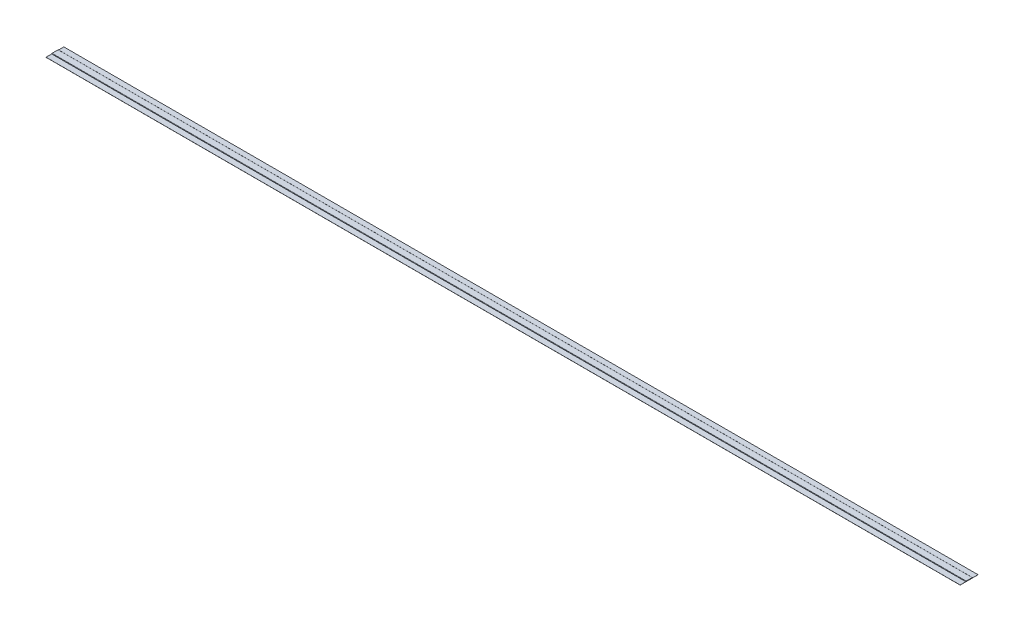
ISO-10303-21;
HEADER;
FILE_DESCRIPTION(('STEP AP214'),'2;1');
FILE_NAME('part.step','',(''),(''),'','','');
FILE_SCHEMA(('AUTOMOTIVE_DESIGN { 1 0 10303 214 1 1 1 1 }'));
ENDSEC;
DATA;
#1=APPLICATION_CONTEXT('core data for automotive mechanical design processes');
#2=APPLICATION_PROTOCOL_DEFINITION('international standard','automotive_design',2000,#1);
#3=PRODUCT_CONTEXT('',#1,'mechanical');
#4=PRODUCT('Part','Part','',(#3));
#5=PRODUCT_RELATED_PRODUCT_CATEGORY('part','',(#4));
#6=PRODUCT_DEFINITION_FORMATION('','',#4);
#7=PRODUCT_DEFINITION_CONTEXT('part definition',#1,'design');
#8=PRODUCT_DEFINITION('design','',#6,#7);
#9=PRODUCT_DEFINITION_SHAPE('','',#8);
#10=(LENGTH_UNIT() NAMED_UNIT(*) SI_UNIT(.MILLI.,.METRE.));
#11=(NAMED_UNIT(*) PLANE_ANGLE_UNIT() SI_UNIT($,.RADIAN.));
#12=(NAMED_UNIT(*) SI_UNIT($,.STERADIAN.) SOLID_ANGLE_UNIT());
#13=UNCERTAINTY_MEASURE_WITH_UNIT(LENGTH_MEASURE(1.E-05),#10,'distance_accuracy_value','');
#14=(GEOMETRIC_REPRESENTATION_CONTEXT(3) GLOBAL_UNCERTAINTY_ASSIGNED_CONTEXT((#13)) GLOBAL_UNIT_ASSIGNED_CONTEXT((#10,
#11,#12)) REPRESENTATION_CONTEXT('',''));
#15=CARTESIAN_POINT('',(0.,0.,0.));
#16=DIRECTION('',(0.,0.,1.));
#17=DIRECTION('',(1.,0.,0.));
#18=AXIS2_PLACEMENT_3D('',#15,#16,#17);
#19=CARTESIAN_POINT('',(-609.6,0.254,23.8125));
#20=DIRECTION('',(0.,1.,0.));
#21=DIRECTION('',(0.,0.,1.));
#22=AXIS2_PLACEMENT_3D('',#19,#20,#21);
#23=PLANE('',#22);
#24=DIRECTION('',(0.,0.,1.));
#25=VECTOR('',#24,1.);
#26=CARTESIAN_POINT('',(-609.6,0.254,-23.8125));
#27=LINE('',#26,#25);
#28=CARTESIAN_POINT('',(-609.6,0.254,-23.8125));
#29=VERTEX_POINT('',#28);
#30=CARTESIAN_POINT('',(-609.6,0.254,-9.396000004));
#31=VERTEX_POINT('',#30);
#32=EDGE_CURVE('E146',#29,#31,#27,.T.);
#33=ORIENTED_EDGE('',*,*,#32,.T.);
#34=DIRECTION('',(1.,0.,0.));
#35=VECTOR('',#34,1.);
#36=CARTESIAN_POINT('',(-627.660600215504,0.254,-9.396000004));
#37=LINE('',#36,#35);
#38=CARTESIAN_POINT('',(1828.8,0.254,-9.396000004));
#39=VERTEX_POINT('',#38);
#40=EDGE_CURVE('E118',#31,#39,#37,.T.);
#41=ORIENTED_EDGE('',*,*,#40,.T.);
#42=DIRECTION('',(0.,0.,-1.));
#43=VECTOR('',#42,1.);
#44=CARTESIAN_POINT('',(1828.8,0.254,-23.8125));
#45=LINE('',#44,#43);
#46=CARTESIAN_POINT('',(1828.8,0.254,-23.8125));
#47=VERTEX_POINT('',#46);
#48=EDGE_CURVE('E132',#39,#47,#45,.T.);
#49=ORIENTED_EDGE('',*,*,#48,.T.);
#50=DIRECTION('',(-1.,0.,0.));
#51=VECTOR('',#50,1.);
#52=CARTESIAN_POINT('',(-609.6,0.254,-23.8125));
#53=LINE('',#52,#51);
#54=EDGE_CURVE('E59',#47,#29,#53,.T.);
#55=ORIENTED_EDGE('',*,*,#54,.T.);
#56=EDGE_LOOP('',(#33,#41,#49,#55));
#57=FACE_BOUND('',#56,.T.);
#58=ADVANCED_FACE('F35',(#57),#23,.T.);
#59=CARTESIAN_POINT('',(-609.6,0.254,-23.8125));
#60=DIRECTION('',(1.,0.,0.));
#61=DIRECTION('',(0.,0.,-1.));
#62=AXIS2_PLACEMENT_3D('',#59,#60,#61);
#63=PLANE('',#62);
#64=DIRECTION('',(0.,0.,1.));
#65=VECTOR('',#64,1.);
#66=CARTESIAN_POINT('',(-609.6,0.,-23.8125));
#67=LINE('',#66,#65);
#68=CARTESIAN_POINT('',(-609.6,0.,-23.8125));
#69=VERTEX_POINT('',#68);
#70=CARTESIAN_POINT('',(-609.6,0.,23.8125));
#71=VERTEX_POINT('',#70);
#72=EDGE_CURVE('E145',#69,#71,#67,.T.);
#73=ORIENTED_EDGE('',*,*,#72,.T.);
#74=DIRECTION('',(0.,-1.,0.));
#75=VECTOR('',#74,1.);
#76=CARTESIAN_POINT('',(-609.6,0.254,23.8125));
#77=LINE('',#76,#75);
#78=CARTESIAN_POINT('',(-609.6,0.254,23.8125));
#79=VERTEX_POINT('',#78);
#80=EDGE_CURVE('E11',#79,#71,#77,.T.);
#81=ORIENTED_EDGE('',*,*,#80,.F.);
#82=CARTESIAN_POINT('',(-609.6,0.254,8.636));
#83=VERTEX_POINT('',#82);
#84=EDGE_CURVE('E88',#83,#79,#27,.T.);
#85=ORIENTED_EDGE('',*,*,#84,.F.);
#86=CARTESIAN_POINT('',(-609.6,0.254,7.62));
#87=DIRECTION('',(1.,0.,0.));
#88=DIRECTION('',(0.,0.,-1.));
#89=AXIS2_PLACEMENT_3D('',#86,#87,#88);
#90=CIRCLE('',#89,1.016);
#91=CARTESIAN_POINT('',(-609.6,1.27,7.62));
#92=VERTEX_POINT('',#91);
#93=EDGE_CURVE('E135',#83,#92,#90,.F.);
#94=ORIENTED_EDGE('',*,*,#93,.T.);
#95=DIRECTION('',(0.,0.,1.));
#96=VECTOR('',#95,1.);
#97=CARTESIAN_POINT('',(-609.6,1.27,0.));
#98=LINE('',#97,#96);
#99=CARTESIAN_POINT('',(-609.6,1.27,-8.380000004));
#100=VERTEX_POINT('',#99);
#101=EDGE_CURVE('E141',#100,#92,#98,.T.);
#102=ORIENTED_EDGE('',*,*,#101,.F.);
#103=CARTESIAN_POINT('',(-609.6,0.254,-8.380000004));
#104=DIRECTION('',(1.,0.,0.));
#105=DIRECTION('',(0.,0.,-1.));
#106=AXIS2_PLACEMENT_3D('',#103,#104,#105);
#107=CIRCLE('',#106,1.016);
#108=EDGE_CURVE('E114',#100,#31,#107,.F.);
#109=ORIENTED_EDGE('',*,*,#108,.T.);
#110=ORIENTED_EDGE('',*,*,#32,.F.);
#111=DIRECTION('',(0.,-1.,0.));
#112=VECTOR('',#111,1.);
#113=CARTESIAN_POINT('',(-609.6,0.254,-23.8125));
#114=LINE('',#113,#112);
#115=EDGE_CURVE('E154',#29,#69,#114,.T.);
#116=ORIENTED_EDGE('',*,*,#115,.T.);
#117=EDGE_LOOP('',(#73,#81,#85,#94,#102,#109,#110,#116));
#118=FACE_BOUND('',#117,.T.);
#119=ADVANCED_FACE('F37',(#118),#63,.F.);
#120=CARTESIAN_POINT('',(-609.6,0.254,23.8125));
#121=DIRECTION('',(0.,0.,-1.));
#122=DIRECTION('',(-1.,0.,0.));
#123=AXIS2_PLACEMENT_3D('',#120,#121,#122);
#124=PLANE('',#123);
#125=DIRECTION('',(1.,0.,0.));
#126=VECTOR('',#125,1.);
#127=CARTESIAN_POINT('',(-609.6,0.,23.8125));
#128=LINE('',#127,#126);
#129=CARTESIAN_POINT('',(1828.8,0.,23.8125));
#130=VERTEX_POINT('',#129);
#131=EDGE_CURVE('E157',#71,#130,#128,.T.);
#132=ORIENTED_EDGE('',*,*,#131,.T.);
#133=DIRECTION('',(0.,-1.,0.));
#134=VECTOR('',#133,1.);
#135=CARTESIAN_POINT('',(1828.8,0.254,23.8125));
#136=LINE('',#135,#134);
#137=CARTESIAN_POINT('',(1828.8,0.254,23.8125));
#138=VERTEX_POINT('',#137);
#139=EDGE_CURVE('E43',#138,#130,#136,.T.);
#140=ORIENTED_EDGE('',*,*,#139,.F.);
#141=DIRECTION('',(1.,0.,0.));
#142=VECTOR('',#141,1.);
#143=CARTESIAN_POINT('',(-609.6,0.254,23.8125));
#144=LINE('',#143,#142);
#145=EDGE_CURVE('E148',#79,#138,#144,.T.);
#146=ORIENTED_EDGE('',*,*,#145,.F.);
#147=ORIENTED_EDGE('',*,*,#80,.T.);
#148=EDGE_LOOP('',(#132,#140,#146,#147));
#149=FACE_BOUND('',#148,.T.);
#150=ADVANCED_FACE('F184',(#149),#124,.F.);
#151=CARTESIAN_POINT('',(1828.8,0.254,-23.8125));
#152=DIRECTION('',(-1.,0.,0.));
#153=DIRECTION('',(0.,0.,1.));
#154=AXIS2_PLACEMENT_3D('',#151,#152,#153);
#155=PLANE('',#154);
#156=DIRECTION('',(0.,0.,-1.));
#157=VECTOR('',#156,1.);
#158=CARTESIAN_POINT('',(1828.8,0.,-23.8125));
#159=LINE('',#158,#157);
#160=CARTESIAN_POINT('',(1828.8,0.,-23.8125));
#161=VERTEX_POINT('',#160);
#162=EDGE_CURVE('E159',#130,#161,#159,.T.);
#163=ORIENTED_EDGE('',*,*,#162,.T.);
#164=DIRECTION('',(0.,-1.,0.));
#165=VECTOR('',#164,1.);
#166=CARTESIAN_POINT('',(1828.8,0.254,-23.8125));
#167=LINE('',#166,#165);
#168=EDGE_CURVE('E163',#47,#161,#167,.T.);
#169=ORIENTED_EDGE('',*,*,#168,.F.);
#170=ORIENTED_EDGE('',*,*,#48,.F.);
#171=CARTESIAN_POINT('',(1828.8,0.254,-8.380000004));
#172=DIRECTION('',(1.,0.,0.));
#173=DIRECTION('',(0.,0.,-1.));
#174=AXIS2_PLACEMENT_3D('',#171,#172,#173);
#175=CIRCLE('',#174,1.016);
#176=CARTESIAN_POINT('',(1828.8,1.27,-8.380000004));
#177=VERTEX_POINT('',#176);
#178=EDGE_CURVE('E50',#39,#177,#175,.T.);
#179=ORIENTED_EDGE('',*,*,#178,.T.);
#180=DIRECTION('',(0.,0.,-1.));
#181=VECTOR('',#180,1.);
#182=CARTESIAN_POINT('',(1828.8,1.27,0.));
#183=LINE('',#182,#181);
#184=CARTESIAN_POINT('',(1828.8,1.27,7.62));
#185=VERTEX_POINT('',#184);
#186=EDGE_CURVE('E121',#185,#177,#183,.T.);
#187=ORIENTED_EDGE('',*,*,#186,.F.);
#188=CARTESIAN_POINT('',(1828.8,0.254,7.62));
#189=DIRECTION('',(1.,0.,0.));
#190=DIRECTION('',(0.,0.,-1.));
#191=AXIS2_PLACEMENT_3D('',#188,#189,#190);
#192=CIRCLE('',#191,1.016);
#193=CARTESIAN_POINT('',(1828.8,0.254,8.636));
#194=VERTEX_POINT('',#193);
#195=EDGE_CURVE('E127',#185,#194,#192,.T.);
#196=ORIENTED_EDGE('',*,*,#195,.T.);
#197=EDGE_CURVE('E150',#138,#194,#45,.T.);
#198=ORIENTED_EDGE('',*,*,#197,.F.);
#199=ORIENTED_EDGE('',*,*,#139,.T.);
#200=EDGE_LOOP('',(#163,#169,#170,#179,#187,#196,#198,#199));
#201=FACE_BOUND('',#200,.T.);
#202=ADVANCED_FACE('F130',(#201),#155,.F.);
#203=CARTESIAN_POINT('',(-609.6,0.254,-23.8125));
#204=DIRECTION('',(0.,0.,1.));
#205=DIRECTION('',(1.,0.,0.));
#206=AXIS2_PLACEMENT_3D('',#203,#204,#205);
#207=PLANE('',#206);
#208=DIRECTION('',(-1.,0.,0.));
#209=VECTOR('',#208,1.);
#210=CARTESIAN_POINT('',(-609.6,0.,-23.8125));
#211=LINE('',#210,#209);
#212=EDGE_CURVE('E80',#161,#69,#211,.T.);
#213=ORIENTED_EDGE('',*,*,#212,.T.);
#214=ORIENTED_EDGE('',*,*,#115,.F.);
#215=ORIENTED_EDGE('',*,*,#54,.F.);
#216=ORIENTED_EDGE('',*,*,#168,.T.);
#217=EDGE_LOOP('',(#213,#214,#215,#216));
#218=FACE_BOUND('',#217,.T.);
#219=ADVANCED_FACE('F175',(#218),#207,.F.);
#220=DIRECTION('',(1.,0.,0.));
#221=VECTOR('',#220,1.);
#222=CARTESIAN_POINT('',(-627.660600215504,0.254,8.636));
#223=LINE('',#222,#221);
#224=EDGE_CURVE('E139',#83,#194,#223,.T.);
#225=ORIENTED_EDGE('',*,*,#224,.F.);
#226=ORIENTED_EDGE('',*,*,#84,.T.);
#227=ORIENTED_EDGE('',*,*,#145,.T.);
#228=ORIENTED_EDGE('',*,*,#197,.T.);
#229=EDGE_LOOP('',(#225,#226,#227,#228));
#230=FACE_BOUND('',#229,.T.);
#231=ADVANCED_FACE('F177',(#230),#23,.T.);
#232=CARTESIAN_POINT('',(-609.6,0.,23.8125));
#233=DIRECTION('',(0.,1.,0.));
#234=DIRECTION('',(0.,0.,1.));
#235=AXIS2_PLACEMENT_3D('',#232,#233,#234);
#236=PLANE('',#235);
#237=ORIENTED_EDGE('',*,*,#72,.F.);
#238=ORIENTED_EDGE('',*,*,#212,.F.);
#239=ORIENTED_EDGE('',*,*,#162,.F.);
#240=ORIENTED_EDGE('',*,*,#131,.F.);
#241=EDGE_LOOP('',(#237,#238,#239,#240));
#242=FACE_BOUND('',#241,.T.);
#243=ADVANCED_FACE('F171',(#242),#236,.F.);
#244=CARTESIAN_POINT('',(-627.660600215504,0.254,7.62));
#245=DIRECTION('',(1.,0.,0.));
#246=DIRECTION('',(0.,0.,-1.));
#247=AXIS2_PLACEMENT_3D('',#244,#245,#246);
#248=CYLINDRICAL_SURFACE('',#247,1.016);
#249=ORIENTED_EDGE('',*,*,#93,.F.);
#250=ORIENTED_EDGE('',*,*,#224,.T.);
#251=ORIENTED_EDGE('',*,*,#195,.F.);
#252=DIRECTION('',(1.,0.,0.));
#253=VECTOR('',#252,1.);
#254=CARTESIAN_POINT('',(-627.660600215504,1.27,7.62));
#255=LINE('',#254,#253);
#256=EDGE_CURVE('E117',#92,#185,#255,.T.);
#257=ORIENTED_EDGE('',*,*,#256,.F.);
#258=EDGE_LOOP('',(#249,#250,#251,#257));
#259=FACE_BOUND('',#258,.T.);
#260=ADVANCED_FACE('F194',(#259),#248,.T.);
#261=CARTESIAN_POINT('',(-627.660600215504,1.27,0.));
#262=DIRECTION('',(0.,-1.,0.));
#263=DIRECTION('',(0.,0.,-1.));
#264=AXIS2_PLACEMENT_3D('',#261,#262,#263);
#265=PLANE('',#264);
#266=DIRECTION('',(1.,0.,0.));
#267=VECTOR('',#266,1.);
#268=CARTESIAN_POINT('',(-627.660600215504,1.27,-8.380000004));
#269=LINE('',#268,#267);
#270=EDGE_CURVE('E111',#100,#177,#269,.T.);
#271=ORIENTED_EDGE('',*,*,#270,.F.);
#272=ORIENTED_EDGE('',*,*,#101,.T.);
#273=ORIENTED_EDGE('',*,*,#256,.T.);
#274=ORIENTED_EDGE('',*,*,#186,.T.);
#275=EDGE_LOOP('',(#271,#272,#273,#274));
#276=FACE_BOUND('',#275,.T.);
#277=ADVANCED_FACE('F122',(#276),#265,.F.);
#278=CARTESIAN_POINT('',(-627.660600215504,0.254,-8.380000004));
#279=DIRECTION('',(1.,0.,0.));
#280=DIRECTION('',(0.,0.,-1.));
#281=AXIS2_PLACEMENT_3D('',#278,#279,#280);
#282=CYLINDRICAL_SURFACE('',#281,1.016);
#283=ORIENTED_EDGE('',*,*,#108,.F.);
#284=ORIENTED_EDGE('',*,*,#270,.T.);
#285=ORIENTED_EDGE('',*,*,#178,.F.);
#286=ORIENTED_EDGE('',*,*,#40,.F.);
#287=EDGE_LOOP('',(#283,#284,#285,#286));
#288=FACE_BOUND('',#287,.T.);
#289=ADVANCED_FACE('F113',(#288),#282,.T.);
#290=CLOSED_SHELL('',(#58,#119,#150,#202,#219,#231,#243,#260,#277,#289));
#291=MANIFOLD_SOLID_BREP('B2',#290);
#292=ADVANCED_BREP_SHAPE_REPRESENTATION('',(#18,#291),#14);
#293=SHAPE_DEFINITION_REPRESENTATION(#9,#292);
ENDSEC;
END-ISO-10303-21;
